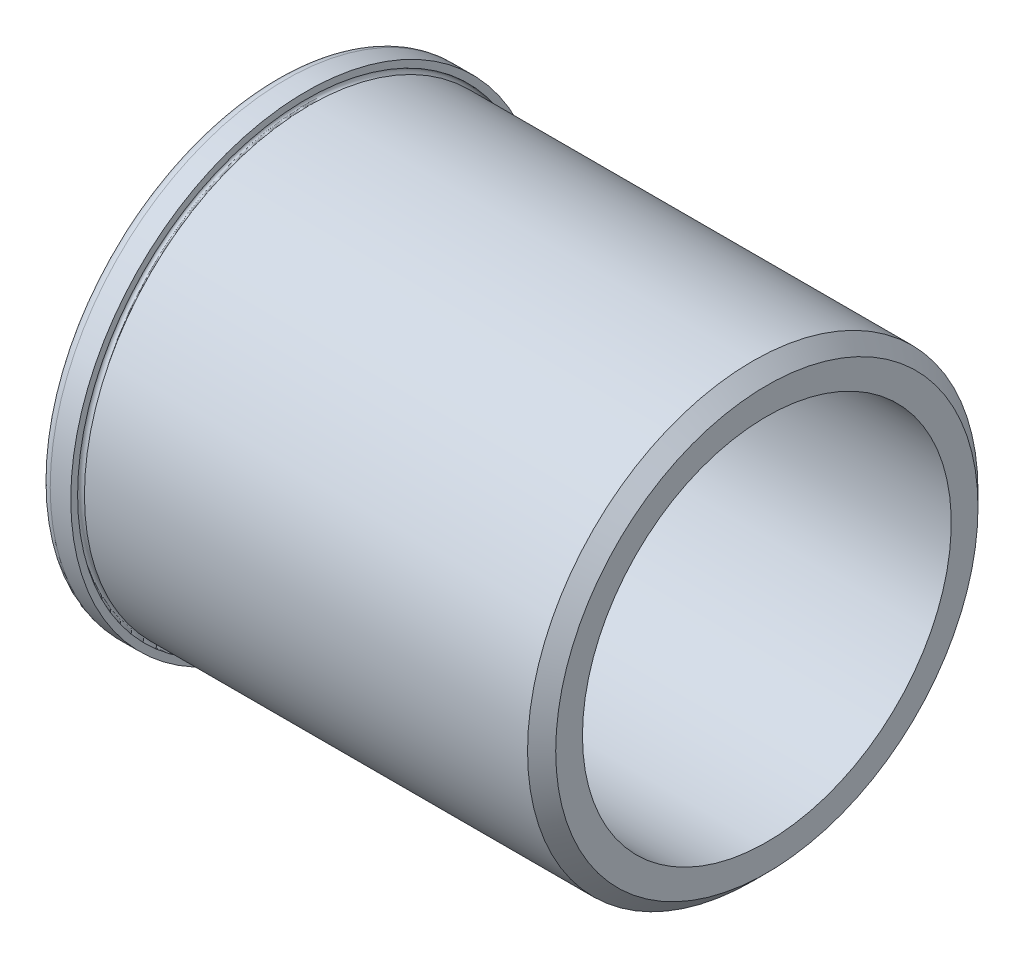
from build123d import *


with BuildPart() as part:
    # Sketch1 → BaseBody (revolve)
    with BuildSketch(Plane.XY, mode=Mode.PRIVATE) as basebody_sk:
        with BuildLine():
            Line((0, 31.76905), (0, 34.925))
            ThreePointArc((0, 34.925), (0.464967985, 36.047532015), (1.5875, 36.5125))
            Line((1.5875, 36.5125), (4.7752, 36.5125))
            Line((4.7752, 36.5125), (4.7752, 35.454166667))
            ThreePointArc((4.7752, 35.454166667), (4.401022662, 34.550822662), (5.304366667, 34.925))
            Line((5.304366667, 34.925), (74.0171875, 34.925))
            Line((74.0171875, 34.925), (76.2, 32.7421875))
            Line((76.2, 32.7421875), (76.2, 28.59405))
            Line((76.2, 28.59405), (3.175, 28.59405))
            ThreePointArc((3.175, 28.59405), (0.92993597, 29.52398597), (0, 31.76905))
        make_face()
    revolve(basebody_sk.sketch.rotate(Axis((0, 0, 0), (1, 0, 0)), 90), axis=Axis((0, 0, 0), (1, 0, 0)))


solid = part.part
